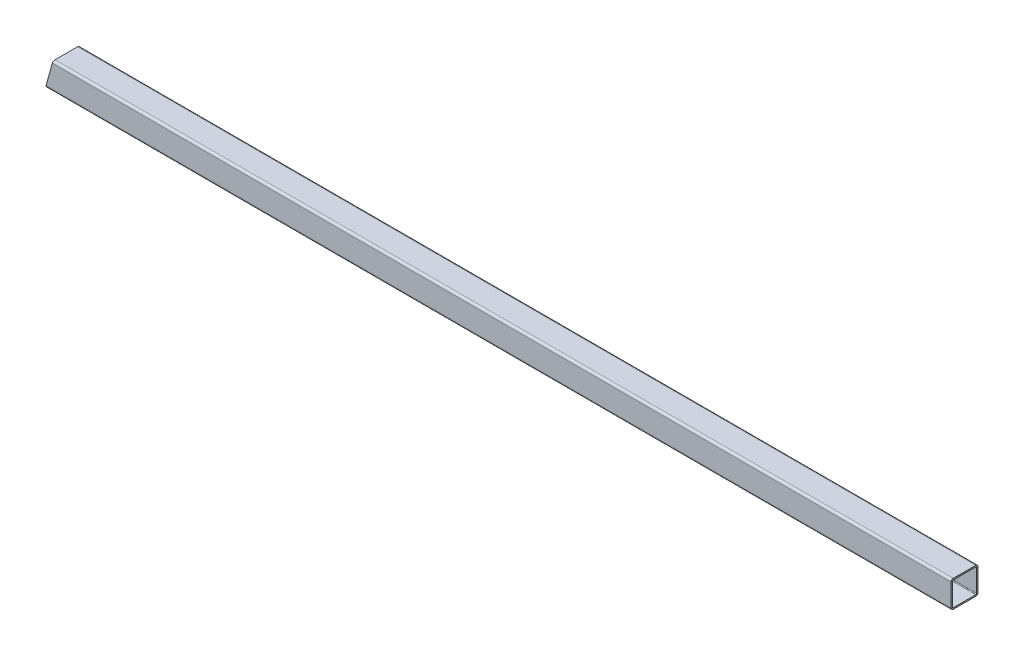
ISO-10303-21;
HEADER;
FILE_DESCRIPTION(('STEP AP214'),'2;1');
FILE_NAME('part.step','',(''),(''),'','','');
FILE_SCHEMA(('AUTOMOTIVE_DESIGN { 1 0 10303 214 1 1 1 1 }'));
ENDSEC;
DATA;
#1=APPLICATION_CONTEXT('core data for automotive mechanical design processes');
#2=APPLICATION_PROTOCOL_DEFINITION('international standard','automotive_design',2000,#1);
#3=PRODUCT_CONTEXT('',#1,'mechanical');
#4=PRODUCT('Part','Part','',(#3));
#5=PRODUCT_RELATED_PRODUCT_CATEGORY('part','',(#4));
#6=PRODUCT_DEFINITION_FORMATION('','',#4);
#7=PRODUCT_DEFINITION_CONTEXT('part definition',#1,'design');
#8=PRODUCT_DEFINITION('design','',#6,#7);
#9=PRODUCT_DEFINITION_SHAPE('','',#8);
#10=(LENGTH_UNIT() NAMED_UNIT(*) SI_UNIT(.MILLI.,.METRE.));
#11=(NAMED_UNIT(*) PLANE_ANGLE_UNIT() SI_UNIT($,.RADIAN.));
#12=(NAMED_UNIT(*) SI_UNIT($,.STERADIAN.) SOLID_ANGLE_UNIT());
#13=UNCERTAINTY_MEASURE_WITH_UNIT(LENGTH_MEASURE(1.E-05),#10,'distance_accuracy_value','');
#14=(GEOMETRIC_REPRESENTATION_CONTEXT(3) GLOBAL_UNCERTAINTY_ASSIGNED_CONTEXT((#13)) GLOBAL_UNIT_ASSIGNED_CONTEXT((#10,
#11,#12)) REPRESENTATION_CONTEXT('',''));
#15=CARTESIAN_POINT('',(0.,0.,0.));
#16=DIRECTION('',(0.,0.,1.));
#17=DIRECTION('',(1.,0.,0.));
#18=AXIS2_PLACEMENT_3D('',#15,#16,#17);
#19=CARTESIAN_POINT('',(1320.8,10.541,21.209));
#20=DIRECTION('',(1.,0.,0.));
#21=DIRECTION('',(0.,0.,-1.));
#22=AXIS2_PLACEMENT_3D('',#19,#20,#21);
#23=PLANE('',#22);
#24=CARTESIAN_POINT('',(1320.8,10.541,21.209));
#25=DIRECTION('',(1.,3.730844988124E-13,-3.73084498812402E-13));
#26=DIRECTION('',(-3.73084498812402E-13,0.,-1.));
#27=AXIS2_PLACEMENT_3D('',#24,#25,#26);
#28=CIRCLE('',#27,1.01599999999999);
#29=CARTESIAN_POINT('',(1320.8,10.541,22.225));
#30=VERTEX_POINT('',#29);
#31=CARTESIAN_POINT('',(1320.8,9.525,21.209));
#32=VERTEX_POINT('',#31);
#33=EDGE_CURVE('E190',#30,#32,#28,.T.);
#34=ORIENTED_EDGE('',*,*,#33,.T.);
#35=DIRECTION('',(0.,0.,-1.));
#36=VECTOR('',#35,1.);
#37=CARTESIAN_POINT('',(1320.8,9.525,21.209));
#38=LINE('',#37,#36);
#39=CARTESIAN_POINT('',(1320.8,9.525,10.541));
#40=VERTEX_POINT('',#39);
#41=EDGE_CURVE('E241',#32,#40,#38,.T.);
#42=ORIENTED_EDGE('',*,*,#41,.T.);
#43=CARTESIAN_POINT('',(1320.8,10.541,10.541));
#44=DIRECTION('',(1.,3.73084498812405E-13,3.73084498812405E-13));
#45=DIRECTION('',(3.73084498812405E-13,0.,-1.));
#46=AXIS2_PLACEMENT_3D('',#43,#44,#45);
#47=CIRCLE('',#46,1.016);
#48=CARTESIAN_POINT('',(1320.8,10.541,9.52499999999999));
#49=VERTEX_POINT('',#48);
#50=EDGE_CURVE('E243',#40,#49,#47,.T.);
#51=ORIENTED_EDGE('',*,*,#50,.T.);
#52=DIRECTION('',(0.,1.,0.));
#53=VECTOR('',#52,1.);
#54=CARTESIAN_POINT('',(1320.8,10.541,9.52499999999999));
#55=LINE('',#54,#53);
#56=CARTESIAN_POINT('',(1320.8,21.209,9.52499999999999));
#57=VERTEX_POINT('',#56);
#58=EDGE_CURVE('E245',#49,#57,#55,.T.);
#59=ORIENTED_EDGE('',*,*,#58,.T.);
#60=CARTESIAN_POINT('',(1320.8,21.209,10.541));
#61=DIRECTION('',(1.,-3.73084498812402E-13,3.73084498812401E-13));
#62=DIRECTION('',(3.73084498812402E-13,1.,0.));
#63=AXIS2_PLACEMENT_3D('',#60,#61,#62);
#64=CIRCLE('',#63,1.016);
#65=CARTESIAN_POINT('',(1320.8,22.225,10.541));
#66=VERTEX_POINT('',#65);
#67=EDGE_CURVE('E247',#57,#66,#64,.T.);
#68=ORIENTED_EDGE('',*,*,#67,.T.);
#69=DIRECTION('',(0.,0.,1.));
#70=VECTOR('',#69,1.);
#71=CARTESIAN_POINT('',(1320.8,22.225,10.541));
#72=LINE('',#71,#70);
#73=CARTESIAN_POINT('',(1320.8,22.225,21.209));
#74=VERTEX_POINT('',#73);
#75=EDGE_CURVE('E249',#66,#74,#72,.T.);
#76=ORIENTED_EDGE('',*,*,#75,.T.);
#77=CARTESIAN_POINT('',(1320.8,21.209,21.209));
#78=DIRECTION('',(1.,0.,0.));
#79=DIRECTION('',(0.,0.,-1.));
#80=AXIS2_PLACEMENT_3D('',#77,#78,#79);
#81=CIRCLE('',#80,1.016);
#82=CARTESIAN_POINT('',(1320.8,21.209,22.225));
#83=VERTEX_POINT('',#82);
#84=EDGE_CURVE('E251',#74,#83,#81,.T.);
#85=ORIENTED_EDGE('',*,*,#84,.T.);
#86=DIRECTION('',(0.,-1.,0.));
#87=VECTOR('',#86,1.);
#88=CARTESIAN_POINT('',(1320.8,21.209,22.225));
#89=LINE('',#88,#87);
#90=EDGE_CURVE('E174',#83,#30,#89,.T.);
#91=ORIENTED_EDGE('',*,*,#90,.T.);
#92=EDGE_LOOP('',(#34,#42,#51,#59,#68,#76,#85,#91));
#93=FACE_BOUND('',#92,.T.);
#94=DIRECTION('',(0.,1.,0.));
#95=VECTOR('',#94,1.);
#96=CARTESIAN_POINT('',(1320.8,10.541,10.1854));
#97=LINE('',#96,#95);
#98=CARTESIAN_POINT('',(1320.8,10.541,10.1854));
#99=VERTEX_POINT('',#98);
#100=CARTESIAN_POINT('',(1320.8,21.209,10.1854));
#101=VERTEX_POINT('',#100);
#102=EDGE_CURVE('E254',#99,#101,#97,.T.);
#103=ORIENTED_EDGE('',*,*,#102,.F.);
#104=CARTESIAN_POINT('',(1320.8,10.541,10.541));
#105=DIRECTION('',(1.,0.,0.));
#106=DIRECTION('',(0.,0.,-1.));
#107=AXIS2_PLACEMENT_3D('',#104,#105,#106);
#108=CIRCLE('',#107,0.355599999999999);
#109=CARTESIAN_POINT('',(1320.8,10.1854,10.541));
#110=VERTEX_POINT('',#109);
#111=EDGE_CURVE('E238',#110,#99,#108,.T.);
#112=ORIENTED_EDGE('',*,*,#111,.F.);
#113=DIRECTION('',(0.,0.,-1.));
#114=VECTOR('',#113,1.);
#115=CARTESIAN_POINT('',(1320.8,10.1854,21.209));
#116=LINE('',#115,#114);
#117=CARTESIAN_POINT('',(1320.8,10.1854,21.209));
#118=VERTEX_POINT('',#117);
#119=EDGE_CURVE('E186',#118,#110,#116,.T.);
#120=ORIENTED_EDGE('',*,*,#119,.F.);
#121=CARTESIAN_POINT('',(1320.8,10.541,21.209));
#122=DIRECTION('',(1.,0.,0.));
#123=DIRECTION('',(0.,0.,-1.));
#124=AXIS2_PLACEMENT_3D('',#121,#122,#123);
#125=CIRCLE('',#124,0.355600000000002);
#126=CARTESIAN_POINT('',(1320.8,10.541,21.5646));
#127=VERTEX_POINT('',#126);
#128=EDGE_CURVE('E211',#127,#118,#125,.T.);
#129=ORIENTED_EDGE('',*,*,#128,.F.);
#130=DIRECTION('',(0.,-1.,0.));
#131=VECTOR('',#130,1.);
#132=CARTESIAN_POINT('',(1320.8,21.209,21.5646));
#133=LINE('',#132,#131);
#134=CARTESIAN_POINT('',(1320.8,21.209,21.5646));
#135=VERTEX_POINT('',#134);
#136=EDGE_CURVE('E260',#135,#127,#133,.T.);
#137=ORIENTED_EDGE('',*,*,#136,.F.);
#138=CARTESIAN_POINT('',(1320.8,21.209,21.209));
#139=DIRECTION('',(1.,0.,0.));
#140=DIRECTION('',(0.,0.,-1.));
#141=AXIS2_PLACEMENT_3D('',#138,#139,#140);
#142=CIRCLE('',#141,0.355600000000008);
#143=CARTESIAN_POINT('',(1320.8,21.5646,21.209));
#144=VERTEX_POINT('',#143);
#145=EDGE_CURVE('E262',#144,#135,#142,.T.);
#146=ORIENTED_EDGE('',*,*,#145,.F.);
#147=DIRECTION('',(0.,0.,1.));
#148=VECTOR('',#147,1.);
#149=CARTESIAN_POINT('',(1320.8,21.5646,10.541));
#150=LINE('',#149,#148);
#151=CARTESIAN_POINT('',(1320.8,21.5646,10.541));
#152=VERTEX_POINT('',#151);
#153=EDGE_CURVE('E264',#152,#144,#150,.T.);
#154=ORIENTED_EDGE('',*,*,#153,.F.);
#155=CARTESIAN_POINT('',(1320.8,21.209,10.541));
#156=DIRECTION('',(1.,0.,0.));
#157=DIRECTION('',(0.,0.,-1.));
#158=AXIS2_PLACEMENT_3D('',#155,#156,#157);
#159=CIRCLE('',#158,0.355599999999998);
#160=EDGE_CURVE('E256',#101,#152,#159,.T.);
#161=ORIENTED_EDGE('',*,*,#160,.F.);
#162=EDGE_LOOP('',(#103,#112,#120,#129,#137,#146,#154,#161));
#163=FACE_BOUND('',#162,.T.);
#164=ADVANCED_FACE('F41',(#93,#163),#23,.T.);
#165=CARTESIAN_POINT('',(1320.8,10.541,21.209));
#166=DIRECTION('',(-1.,0.,0.));
#167=DIRECTION('',(0.,0.,1.));
#168=AXIS2_PLACEMENT_3D('',#165,#166,#167);
#169=CYLINDRICAL_SURFACE('',#168,1.016);
#170=DIRECTION('',(-1.,0.,0.));
#171=VECTOR('',#170,1.);
#172=CARTESIAN_POINT('',(1320.8,10.541,22.225));
#173=LINE('',#172,#171);
#174=CARTESIAN_POINT('',(892.871634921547,10.541,22.225));
#175=VERTEX_POINT('',#174);
#176=EDGE_CURVE('E175',#30,#175,#173,.T.);
#177=ORIENTED_EDGE('',*,*,#176,.T.);
#178=CARTESIAN_POINT('',(892.871634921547,10.541,21.209));
#179=DIRECTION('',(0.963898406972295,-0.266270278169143,0.));
#180=DIRECTION('',(-0.266270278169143,-0.963898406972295,0.));
#181=AXIS2_PLACEMENT_3D('',#178,#179,#180);
#182=ELLIPSE('',#181,1.05405299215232,1.016);
#183=CARTESIAN_POINT('',(892.590971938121,9.525,21.209));
#184=VERTEX_POINT('',#183);
#185=EDGE_CURVE('E56',#175,#184,#182,.T.);
#186=ORIENTED_EDGE('',*,*,#185,.T.);
#187=DIRECTION('',(-1.,0.,0.));
#188=VECTOR('',#187,1.);
#189=CARTESIAN_POINT('',(1320.8,9.525,21.209));
#190=LINE('',#189,#188);
#191=EDGE_CURVE('E49',#32,#184,#190,.T.);
#192=ORIENTED_EDGE('',*,*,#191,.F.);
#193=ORIENTED_EDGE('',*,*,#33,.F.);
#194=EDGE_LOOP('',(#177,#186,#192,#193));
#195=FACE_BOUND('',#194,.T.);
#196=ADVANCED_FACE('F332',(#195),#169,.T.);
#197=CARTESIAN_POINT('',(1320.8,9.525,21.209));
#198=DIRECTION('',(0.,1.,0.));
#199=DIRECTION('',(0.,0.,1.));
#200=AXIS2_PLACEMENT_3D('',#197,#198,#199);
#201=PLANE('',#200);
#202=ORIENTED_EDGE('',*,*,#191,.T.);
#203=DIRECTION('',(0.,0.,-1.));
#204=VECTOR('',#203,1.);
#205=CARTESIAN_POINT('',(892.590971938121,9.525,21.209));
#206=LINE('',#205,#204);
#207=CARTESIAN_POINT('',(892.590971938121,9.525,10.541));
#208=VERTEX_POINT('',#207);
#209=EDGE_CURVE('E234',#184,#208,#206,.T.);
#210=ORIENTED_EDGE('',*,*,#209,.T.);
#211=DIRECTION('',(-1.,0.,0.));
#212=VECTOR('',#211,1.);
#213=CARTESIAN_POINT('',(1320.8,9.525,10.541));
#214=LINE('',#213,#212);
#215=EDGE_CURVE('E268',#40,#208,#214,.T.);
#216=ORIENTED_EDGE('',*,*,#215,.F.);
#217=ORIENTED_EDGE('',*,*,#41,.F.);
#218=EDGE_LOOP('',(#202,#210,#216,#217));
#219=FACE_BOUND('',#218,.T.);
#220=ADVANCED_FACE('F338',(#219),#201,.F.);
#221=CARTESIAN_POINT('',(1320.8,10.541,10.541));
#222=DIRECTION('',(-1.,0.,0.));
#223=DIRECTION('',(0.,0.,1.));
#224=AXIS2_PLACEMENT_3D('',#221,#222,#223);
#225=CYLINDRICAL_SURFACE('',#224,1.016);
#226=ORIENTED_EDGE('',*,*,#215,.T.);
#227=CARTESIAN_POINT('',(892.871634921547,10.541,10.541));
#228=DIRECTION('',(0.963898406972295,-0.266270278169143,0.));
#229=DIRECTION('',(-0.266270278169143,-0.963898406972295,0.));
#230=AXIS2_PLACEMENT_3D('',#227,#228,#229);
#231=ELLIPSE('',#230,1.05405299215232,1.016);
#232=CARTESIAN_POINT('',(892.871634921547,10.541,9.52499999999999));
#233=VERTEX_POINT('',#232);
#234=EDGE_CURVE('E231',#208,#233,#231,.T.);
#235=ORIENTED_EDGE('',*,*,#234,.T.);
#236=DIRECTION('',(-1.,0.,0.));
#237=VECTOR('',#236,1.);
#238=CARTESIAN_POINT('',(1320.8,10.541,9.52499999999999));
#239=LINE('',#238,#237);
#240=EDGE_CURVE('E272',#49,#233,#239,.T.);
#241=ORIENTED_EDGE('',*,*,#240,.F.);
#242=ORIENTED_EDGE('',*,*,#50,.F.);
#243=EDGE_LOOP('',(#226,#235,#241,#242));
#244=FACE_BOUND('',#243,.T.);
#245=ADVANCED_FACE('F345',(#244),#225,.T.);
#246=CARTESIAN_POINT('',(1320.8,10.541,9.52499999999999));
#247=DIRECTION('',(0.,0.,1.));
#248=DIRECTION('',(1.,0.,0.));
#249=AXIS2_PLACEMENT_3D('',#246,#247,#248);
#250=PLANE('',#249);
#251=ORIENTED_EDGE('',*,*,#240,.T.);
#252=DIRECTION('',(0.266270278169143,0.963898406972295,0.));
#253=VECTOR('',#252,1.);
#254=CARTESIAN_POINT('',(896.418706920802,23.3814006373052,9.52499999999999));
#255=LINE('',#254,#253);
#256=CARTESIAN_POINT('',(895.818596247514,21.209,9.52499999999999));
#257=VERTEX_POINT('',#256);
#258=EDGE_CURVE('E159',#233,#257,#255,.T.);
#259=ORIENTED_EDGE('',*,*,#258,.T.);
#260=DIRECTION('',(-1.,0.,0.));
#261=VECTOR('',#260,1.);
#262=CARTESIAN_POINT('',(1320.8,21.209,9.52499999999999));
#263=LINE('',#262,#261);
#264=EDGE_CURVE('E275',#57,#257,#263,.T.);
#265=ORIENTED_EDGE('',*,*,#264,.F.);
#266=ORIENTED_EDGE('',*,*,#58,.F.);
#267=EDGE_LOOP('',(#251,#259,#265,#266));
#268=FACE_BOUND('',#267,.T.);
#269=ADVANCED_FACE('F288',(#268),#250,.F.);
#270=CARTESIAN_POINT('',(1320.8,21.209,10.541));
#271=DIRECTION('',(-1.,0.,0.));
#272=DIRECTION('',(0.,0.,1.));
#273=AXIS2_PLACEMENT_3D('',#270,#271,#272);
#274=CYLINDRICAL_SURFACE('',#273,1.016);
#275=ORIENTED_EDGE('',*,*,#264,.T.);
#276=CARTESIAN_POINT('',(895.818596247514,21.209,10.541));
#277=DIRECTION('',(0.963898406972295,-0.266270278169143,0.));
#278=DIRECTION('',(-0.266270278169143,-0.963898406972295,0.));
#279=AXIS2_PLACEMENT_3D('',#276,#277,#278);
#280=ELLIPSE('',#279,1.05405299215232,1.016);
#281=CARTESIAN_POINT('',(896.099259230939,22.225,10.541));
#282=VERTEX_POINT('',#281);
#283=EDGE_CURVE('E228',#257,#282,#280,.T.);
#284=ORIENTED_EDGE('',*,*,#283,.T.);
#285=DIRECTION('',(-1.,0.,0.));
#286=VECTOR('',#285,1.);
#287=CARTESIAN_POINT('',(1320.8,22.225,10.541));
#288=LINE('',#287,#286);
#289=EDGE_CURVE('E177',#66,#282,#288,.T.);
#290=ORIENTED_EDGE('',*,*,#289,.F.);
#291=ORIENTED_EDGE('',*,*,#67,.F.);
#292=EDGE_LOOP('',(#275,#284,#290,#291));
#293=FACE_BOUND('',#292,.T.);
#294=ADVANCED_FACE('F284',(#293),#274,.T.);
#295=CARTESIAN_POINT('',(1320.8,22.225,10.541));
#296=DIRECTION('',(0.,-1.,0.));
#297=DIRECTION('',(0.,0.,-1.));
#298=AXIS2_PLACEMENT_3D('',#295,#296,#297);
#299=PLANE('',#298);
#300=ORIENTED_EDGE('',*,*,#289,.T.);
#301=DIRECTION('',(0.,0.,1.));
#302=VECTOR('',#301,1.);
#303=CARTESIAN_POINT('',(896.099259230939,22.225,10.541));
#304=LINE('',#303,#302);
#305=CARTESIAN_POINT('',(896.099259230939,22.225,21.209));
#306=VERTEX_POINT('',#305);
#307=EDGE_CURVE('E170',#282,#306,#304,.T.);
#308=ORIENTED_EDGE('',*,*,#307,.T.);
#309=DIRECTION('',(-1.,0.,0.));
#310=VECTOR('',#309,1.);
#311=CARTESIAN_POINT('',(1320.8,22.225,21.209));
#312=LINE('',#311,#310);
#313=EDGE_CURVE('E169',#74,#306,#312,.T.);
#314=ORIENTED_EDGE('',*,*,#313,.F.);
#315=ORIENTED_EDGE('',*,*,#75,.F.);
#316=EDGE_LOOP('',(#300,#308,#314,#315));
#317=FACE_BOUND('',#316,.T.);
#318=ADVANCED_FACE('F281',(#317),#299,.F.);
#319=CARTESIAN_POINT('',(1320.8,21.209,21.209));
#320=DIRECTION('',(-1.,0.,0.));
#321=DIRECTION('',(0.,0.,1.));
#322=AXIS2_PLACEMENT_3D('',#319,#320,#321);
#323=CYLINDRICAL_SURFACE('',#322,1.016);
#324=ORIENTED_EDGE('',*,*,#313,.T.);
#325=CARTESIAN_POINT('',(895.818596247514,21.209,21.209));
#326=DIRECTION('',(0.963898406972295,-0.266270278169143,0.));
#327=DIRECTION('',(-0.266270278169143,-0.963898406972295,0.));
#328=AXIS2_PLACEMENT_3D('',#325,#326,#327);
#329=ELLIPSE('',#328,1.05405299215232,1.016);
#330=CARTESIAN_POINT('',(895.818596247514,21.209,22.225));
#331=VERTEX_POINT('',#330);
#332=EDGE_CURVE('E153',#306,#331,#329,.T.);
#333=ORIENTED_EDGE('',*,*,#332,.T.);
#334=DIRECTION('',(-1.,0.,0.));
#335=VECTOR('',#334,1.);
#336=CARTESIAN_POINT('',(1320.8,21.209,22.225));
#337=LINE('',#336,#335);
#338=EDGE_CURVE('E166',#83,#331,#337,.T.);
#339=ORIENTED_EDGE('',*,*,#338,.F.);
#340=ORIENTED_EDGE('',*,*,#84,.F.);
#341=EDGE_LOOP('',(#324,#333,#339,#340));
#342=FACE_BOUND('',#341,.T.);
#343=ADVANCED_FACE('F164',(#342),#323,.T.);
#344=CARTESIAN_POINT('',(1320.8,21.209,22.225));
#345=DIRECTION('',(0.,0.,-1.));
#346=DIRECTION('',(0.,1.,0.));
#347=AXIS2_PLACEMENT_3D('',#344,#345,#346);
#348=PLANE('',#347);
#349=ORIENTED_EDGE('',*,*,#338,.T.);
#350=DIRECTION('',(0.266270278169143,0.963898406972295,0.));
#351=VECTOR('',#350,1.);
#352=CARTESIAN_POINT('',(896.418706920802,23.3814006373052,22.225));
#353=LINE('',#352,#351);
#354=EDGE_CURVE('E150',#175,#331,#353,.T.);
#355=ORIENTED_EDGE('',*,*,#354,.F.);
#356=ORIENTED_EDGE('',*,*,#176,.F.);
#357=ORIENTED_EDGE('',*,*,#90,.F.);
#358=EDGE_LOOP('',(#349,#355,#356,#357));
#359=FACE_BOUND('',#358,.T.);
#360=ADVANCED_FACE('F173',(#359),#348,.F.);
#361=CARTESIAN_POINT('',(1320.8,10.541,10.541));
#362=DIRECTION('',(-1.,0.,0.));
#363=DIRECTION('',(0.,0.,1.));
#364=AXIS2_PLACEMENT_3D('',#361,#362,#363);
#365=CYLINDRICAL_SURFACE('',#364,0.3556);
#366=CARTESIAN_POINT('',(892.871634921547,10.541,10.541));
#367=DIRECTION('',(0.963898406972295,-0.266270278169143,0.));
#368=DIRECTION('',(-0.266270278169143,-0.963898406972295,0.));
#369=AXIS2_PLACEMENT_3D('',#366,#367,#368);
#370=ELLIPSE('',#369,0.368918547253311,0.3556);
#371=CARTESIAN_POINT('',(892.773402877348,10.1854,10.541));
#372=VERTEX_POINT('',#371);
#373=CARTESIAN_POINT('',(892.871634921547,10.541,10.1854));
#374=VERTEX_POINT('',#373);
#375=EDGE_CURVE('E171',#372,#374,#370,.T.);
#376=ORIENTED_EDGE('',*,*,#375,.F.);
#377=DIRECTION('',(-1.,0.,0.));
#378=VECTOR('',#377,1.);
#379=CARTESIAN_POINT('',(1320.8,10.1854,10.541));
#380=LINE('',#379,#378);
#381=EDGE_CURVE('E182',#110,#372,#380,.T.);
#382=ORIENTED_EDGE('',*,*,#381,.F.);
#383=ORIENTED_EDGE('',*,*,#111,.T.);
#384=DIRECTION('',(-1.,0.,0.));
#385=VECTOR('',#384,1.);
#386=CARTESIAN_POINT('',(1320.8,10.541,10.1854));
#387=LINE('',#386,#385);
#388=EDGE_CURVE('E187',#99,#374,#387,.T.);
#389=ORIENTED_EDGE('',*,*,#388,.T.);
#390=EDGE_LOOP('',(#376,#382,#383,#389));
#391=FACE_BOUND('',#390,.T.);
#392=ADVANCED_FACE('F218',(#391),#365,.F.);
#393=CARTESIAN_POINT('',(1320.8,10.541,10.1854));
#394=DIRECTION('',(0.,0.,1.));
#395=DIRECTION('',(1.,0.,0.));
#396=AXIS2_PLACEMENT_3D('',#393,#394,#395);
#397=PLANE('',#396);
#398=DIRECTION('',(0.266270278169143,0.963898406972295,0.));
#399=VECTOR('',#398,1.);
#400=CARTESIAN_POINT('',(923.211696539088,120.372023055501,10.1854));
#401=LINE('',#400,#399);
#402=CARTESIAN_POINT('',(895.818596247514,21.209,10.1854));
#403=VERTEX_POINT('',#402);
#404=EDGE_CURVE('E221',#374,#403,#401,.T.);
#405=ORIENTED_EDGE('',*,*,#404,.F.);
#406=ORIENTED_EDGE('',*,*,#388,.F.);
#407=ORIENTED_EDGE('',*,*,#102,.T.);
#408=DIRECTION('',(-1.,0.,0.));
#409=VECTOR('',#408,1.);
#410=CARTESIAN_POINT('',(1320.8,21.209,10.1854));
#411=LINE('',#410,#409);
#412=EDGE_CURVE('E191',#101,#403,#411,.T.);
#413=ORIENTED_EDGE('',*,*,#412,.T.);
#414=EDGE_LOOP('',(#405,#406,#407,#413));
#415=FACE_BOUND('',#414,.T.);
#416=ADVANCED_FACE('F322',(#415),#397,.T.);
#417=CARTESIAN_POINT('',(1320.8,21.209,10.541));
#418=DIRECTION('',(-1.,0.,0.));
#419=DIRECTION('',(0.,0.,1.));
#420=AXIS2_PLACEMENT_3D('',#417,#418,#419);
#421=CYLINDRICAL_SURFACE('',#420,0.3556);
#422=CARTESIAN_POINT('',(895.818596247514,21.209,10.541));
#423=DIRECTION('',(0.963898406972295,-0.266270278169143,0.));
#424=DIRECTION('',(-0.266270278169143,-0.963898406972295,0.));
#425=AXIS2_PLACEMENT_3D('',#422,#423,#424);
#426=ELLIPSE('',#425,0.368918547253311,0.3556);
#427=CARTESIAN_POINT('',(895.916828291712,21.5646,10.541));
#428=VERTEX_POINT('',#427);
#429=EDGE_CURVE('E223',#403,#428,#426,.T.);
#430=ORIENTED_EDGE('',*,*,#429,.F.);
#431=ORIENTED_EDGE('',*,*,#412,.F.);
#432=ORIENTED_EDGE('',*,*,#160,.T.);
#433=DIRECTION('',(-1.,0.,0.));
#434=VECTOR('',#433,1.);
#435=CARTESIAN_POINT('',(1320.8,21.5646,10.541));
#436=LINE('',#435,#434);
#437=EDGE_CURVE('E194',#152,#428,#436,.T.);
#438=ORIENTED_EDGE('',*,*,#437,.T.);
#439=EDGE_LOOP('',(#430,#431,#432,#438));
#440=FACE_BOUND('',#439,.T.);
#441=ADVANCED_FACE('F309',(#440),#421,.F.);
#442=CARTESIAN_POINT('',(1320.8,21.5646,10.541));
#443=DIRECTION('',(0.,-1.,0.));
#444=DIRECTION('',(0.,0.,-1.));
#445=AXIS2_PLACEMENT_3D('',#442,#443,#444);
#446=PLANE('',#445);
#447=DIRECTION('',(0.,0.,1.));
#448=VECTOR('',#447,1.);
#449=CARTESIAN_POINT('',(895.916828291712,21.5646,10.541));
#450=LINE('',#449,#448);
#451=CARTESIAN_POINT('',(895.916828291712,21.5646,21.209));
#452=VERTEX_POINT('',#451);
#453=EDGE_CURVE('E298',#428,#452,#450,.T.);
#454=ORIENTED_EDGE('',*,*,#453,.F.);
#455=ORIENTED_EDGE('',*,*,#437,.F.);
#456=ORIENTED_EDGE('',*,*,#153,.T.);
#457=DIRECTION('',(-1.,0.,0.));
#458=VECTOR('',#457,1.);
#459=CARTESIAN_POINT('',(1320.8,21.5646,21.209));
#460=LINE('',#459,#458);
#461=EDGE_CURVE('E197',#144,#452,#460,.T.);
#462=ORIENTED_EDGE('',*,*,#461,.T.);
#463=EDGE_LOOP('',(#454,#455,#456,#462));
#464=FACE_BOUND('',#463,.T.);
#465=ADVANCED_FACE('F306',(#464),#446,.T.);
#466=CARTESIAN_POINT('',(1320.8,21.209,21.209));
#467=DIRECTION('',(-1.,0.,0.));
#468=DIRECTION('',(0.,0.,1.));
#469=AXIS2_PLACEMENT_3D('',#466,#467,#468);
#470=CYLINDRICAL_SURFACE('',#469,0.355600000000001);
#471=CARTESIAN_POINT('',(895.818596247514,21.209,21.209));
#472=DIRECTION('',(0.963898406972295,-0.266270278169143,0.));
#473=DIRECTION('',(-0.266270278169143,-0.963898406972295,0.));
#474=AXIS2_PLACEMENT_3D('',#471,#472,#473);
#475=ELLIPSE('',#474,0.368918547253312,0.355600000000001);
#476=CARTESIAN_POINT('',(895.818596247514,21.209,21.5646));
#477=VERTEX_POINT('',#476);
#478=EDGE_CURVE('E296',#452,#477,#475,.T.);
#479=ORIENTED_EDGE('',*,*,#478,.F.);
#480=ORIENTED_EDGE('',*,*,#461,.F.);
#481=ORIENTED_EDGE('',*,*,#145,.T.);
#482=DIRECTION('',(-1.,0.,0.));
#483=VECTOR('',#482,1.);
#484=CARTESIAN_POINT('',(1320.8,21.209,21.5646));
#485=LINE('',#484,#483);
#486=EDGE_CURVE('E200',#135,#477,#485,.T.);
#487=ORIENTED_EDGE('',*,*,#486,.T.);
#488=EDGE_LOOP('',(#479,#480,#481,#487));
#489=FACE_BOUND('',#488,.T.);
#490=ADVANCED_FACE('F316',(#489),#470,.F.);
#491=CARTESIAN_POINT('',(1320.8,21.209,21.5646));
#492=DIRECTION('',(0.,0.,-1.));
#493=DIRECTION('',(-1.,0.,0.));
#494=AXIS2_PLACEMENT_3D('',#491,#492,#493);
#495=PLANE('',#494);
#496=DIRECTION('',(-0.266270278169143,-0.963898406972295,0.));
#497=VECTOR('',#496,1.);
#498=CARTESIAN_POINT('',(925.949718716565,130.283663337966,21.5646));
#499=LINE('',#498,#497);
#500=CARTESIAN_POINT('',(892.871634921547,10.541,21.5646));
#501=VERTEX_POINT('',#500);
#502=EDGE_CURVE('E292',#477,#501,#499,.T.);
#503=ORIENTED_EDGE('',*,*,#502,.F.);
#504=ORIENTED_EDGE('',*,*,#486,.F.);
#505=ORIENTED_EDGE('',*,*,#136,.T.);
#506=DIRECTION('',(-1.,0.,0.));
#507=VECTOR('',#506,1.);
#508=CARTESIAN_POINT('',(1320.8,10.541,21.5646));
#509=LINE('',#508,#507);
#510=EDGE_CURVE('E203',#127,#501,#509,.T.);
#511=ORIENTED_EDGE('',*,*,#510,.T.);
#512=EDGE_LOOP('',(#503,#504,#505,#511));
#513=FACE_BOUND('',#512,.T.);
#514=ADVANCED_FACE('F320',(#513),#495,.T.);
#515=CARTESIAN_POINT('',(1320.8,10.541,21.209));
#516=DIRECTION('',(-1.,0.,0.));
#517=DIRECTION('',(0.,0.,1.));
#518=AXIS2_PLACEMENT_3D('',#515,#516,#517);
#519=CYLINDRICAL_SURFACE('',#518,0.355600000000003);
#520=CARTESIAN_POINT('',(892.871634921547,10.541,21.209));
#521=DIRECTION('',(0.963898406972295,-0.266270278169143,0.));
#522=DIRECTION('',(-0.266270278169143,-0.963898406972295,0.));
#523=AXIS2_PLACEMENT_3D('',#520,#521,#522);
#524=ELLIPSE('',#523,0.368918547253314,0.355600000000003);
#525=CARTESIAN_POINT('',(892.773402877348,10.1854,21.209));
#526=VERTEX_POINT('',#525);
#527=EDGE_CURVE('E63',#501,#526,#524,.T.);
#528=ORIENTED_EDGE('',*,*,#527,.F.);
#529=ORIENTED_EDGE('',*,*,#510,.F.);
#530=ORIENTED_EDGE('',*,*,#128,.T.);
#531=DIRECTION('',(-1.,0.,0.));
#532=VECTOR('',#531,1.);
#533=CARTESIAN_POINT('',(1320.8,10.1854,21.209));
#534=LINE('',#533,#532);
#535=EDGE_CURVE('E185',#118,#526,#534,.T.);
#536=ORIENTED_EDGE('',*,*,#535,.T.);
#537=EDGE_LOOP('',(#528,#529,#530,#536));
#538=FACE_BOUND('',#537,.T.);
#539=ADVANCED_FACE('F208',(#538),#519,.F.);
#540=CARTESIAN_POINT('',(1320.8,10.1854,21.209));
#541=DIRECTION('',(0.,1.,0.));
#542=DIRECTION('',(0.,0.,1.));
#543=AXIS2_PLACEMENT_3D('',#540,#541,#542);
#544=PLANE('',#543);
#545=DIRECTION('',(0.,0.,-1.));
#546=VECTOR('',#545,1.);
#547=CARTESIAN_POINT('',(892.773402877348,10.1854,21.209));
#548=LINE('',#547,#546);
#549=EDGE_CURVE('E11',#526,#372,#548,.T.);
#550=ORIENTED_EDGE('',*,*,#549,.F.);
#551=ORIENTED_EDGE('',*,*,#535,.F.);
#552=ORIENTED_EDGE('',*,*,#119,.T.);
#553=ORIENTED_EDGE('',*,*,#381,.T.);
#554=EDGE_LOOP('',(#550,#551,#552,#553));
#555=FACE_BOUND('',#554,.T.);
#556=ADVANCED_FACE('F43',(#555),#544,.T.);
#557=CARTESIAN_POINT('',(896.418706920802,23.3814006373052,9.52499999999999));
#558=DIRECTION('',(0.963898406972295,-0.266270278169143,0.));
#559=DIRECTION('',(0.266270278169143,0.963898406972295,0.));
#560=AXIS2_PLACEMENT_3D('',#557,#558,#559);
#561=PLANE('',#560);
#562=ORIENTED_EDGE('',*,*,#375,.T.);
#563=ORIENTED_EDGE('',*,*,#404,.T.);
#564=ORIENTED_EDGE('',*,*,#429,.T.);
#565=ORIENTED_EDGE('',*,*,#453,.T.);
#566=ORIENTED_EDGE('',*,*,#478,.T.);
#567=ORIENTED_EDGE('',*,*,#502,.T.);
#568=ORIENTED_EDGE('',*,*,#527,.T.);
#569=ORIENTED_EDGE('',*,*,#549,.T.);
#570=EDGE_LOOP('',(#562,#563,#564,#565,#566,#567,#568,#569));
#571=FACE_BOUND('',#570,.T.);
#572=ORIENTED_EDGE('',*,*,#354,.T.);
#573=ORIENTED_EDGE('',*,*,#332,.F.);
#574=ORIENTED_EDGE('',*,*,#307,.F.);
#575=ORIENTED_EDGE('',*,*,#283,.F.);
#576=ORIENTED_EDGE('',*,*,#258,.F.);
#577=ORIENTED_EDGE('',*,*,#234,.F.);
#578=ORIENTED_EDGE('',*,*,#209,.F.);
#579=ORIENTED_EDGE('',*,*,#185,.F.);
#580=EDGE_LOOP('',(#572,#573,#574,#575,#576,#577,#578,#579));
#581=FACE_BOUND('',#580,.T.);
#582=ADVANCED_FACE('F152',(#571,#581),#561,.F.);
#583=CLOSED_SHELL('',(#164,#196,#220,#245,#269,#294,#318,#343,#360,#392,#416,#441,#465,#490,
#514,#539,#556,#582));
#584=MANIFOLD_SOLID_BREP('B2',#583);
#585=ADVANCED_BREP_SHAPE_REPRESENTATION('',(#18,#584),#14);
#586=SHAPE_DEFINITION_REPRESENTATION(#9,#585);
ENDSEC;
END-ISO-10303-21;
